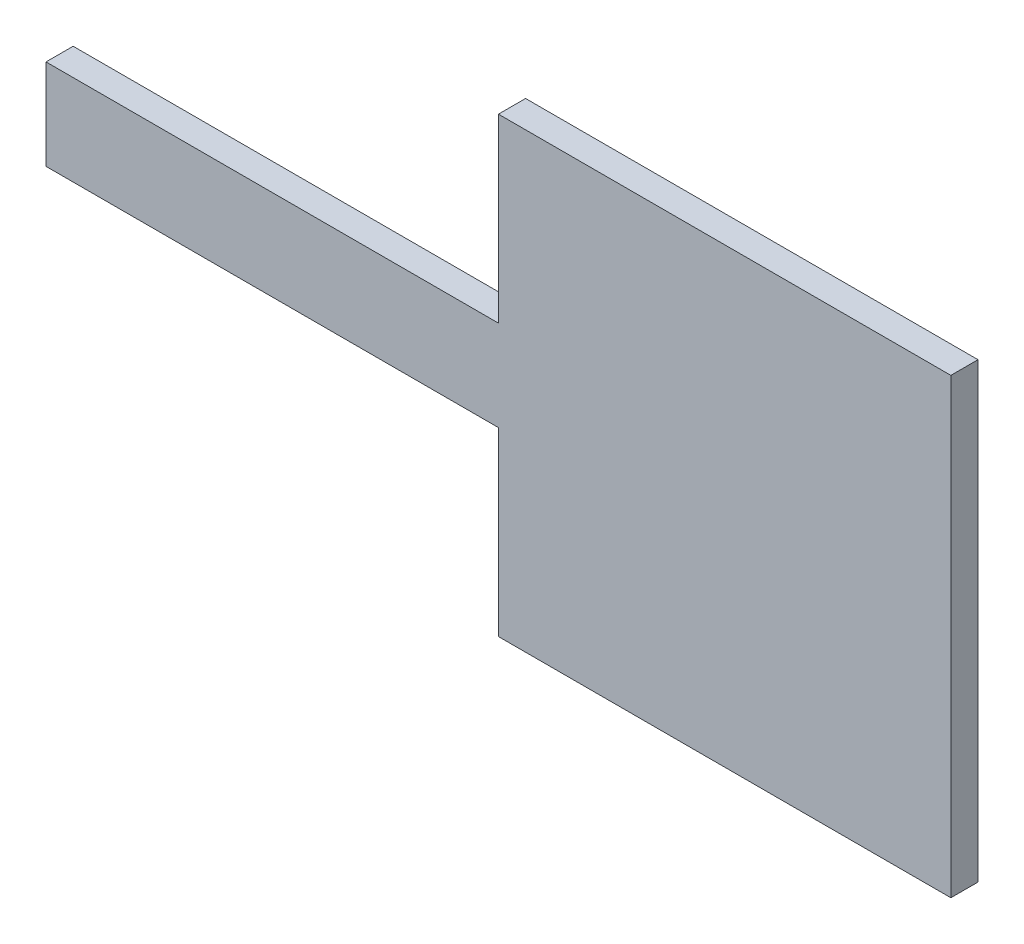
from build123d import *

# Parameters (mm, degrees)
SALIENTE_EXTRUIR1_DEPTH = 3


with BuildPart() as part:
    # Croquis1 → Saliente-Extruir1 (new body)
    with BuildSketch(Plane.XY):
        Polygon((-25, 5), (-75, 5), (-75, -5), (-25, -5), (-25, -25), (25, -25), (25, 25), (-25, 25), align=None)
    extrude(amount=SALIENTE_EXTRUIR1_DEPTH)


solid = part.part
